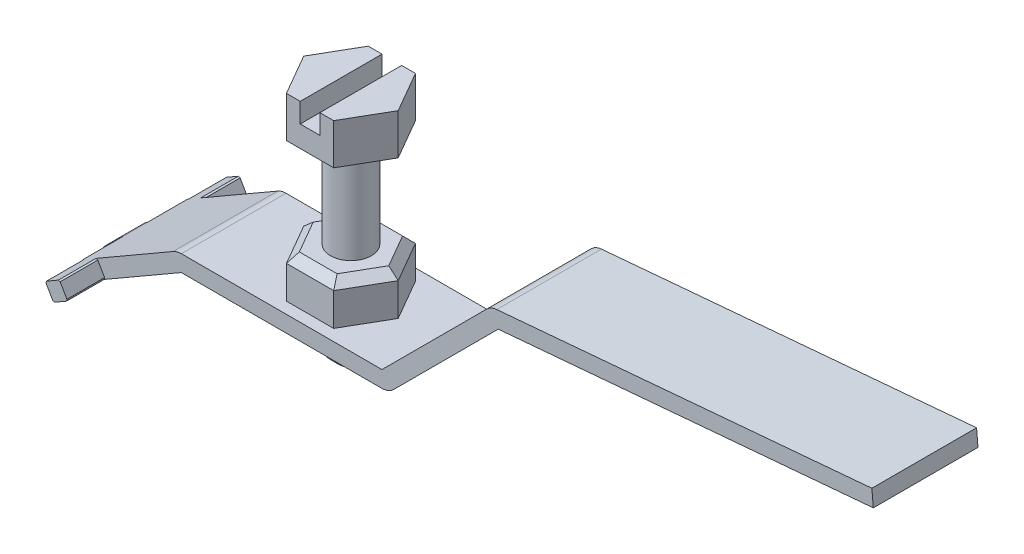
from build123d import *

# Parameters (mm, degrees)
BOSS_EXTRU_1_DEPTH      = 3.2
BOSS_EXTRU_2_DEPTH      = 5.5
ESQUISSE3_OUTSIDE_W     = 60.549
ESQUISSE3_OUTSIDE_H     = 25.111
ESQUISSE3_OUTSIDE_R     = 0.65
ENL_V_MAT_EXTRU_1_DEPTH = 2.3
ESQUISSE4_OUTSIDE_W     = 60.549
ESQUISSE4_OUTSIDE_H     = 25.111
ESQUISSE4_OUTSIDE_R     = 0.65
ENL_V_MAT_EXTRU_2_DEPTH = 2.3
ESQUISSE6_R             = 1.5
ENL_V_MAT_EXTRU_3_DEPTH = 11
ESQUISSE7_R             = 1
BOSS_EXTRU_3_DEPTH      = 2.5
CHANFREIN1_SIZE         = 0.5
BOSS_EXTRU_4_DEPTH      = 6
BOSS_EXTRU_4_DEPTH_BACK = 6
ESQUISSE8_R             = 1.25
CHANFREIN2_SIZE         = 0.5
BOSS_EXTRU_5_DEPTH      = 2.5
ESQUISSE10_W            = 1.2
ESQUISSE10_H            = 1.2
ENL_V_MAT_EXTRU_4_DEPTH = 5
BOSS_EXTRU_6_DEPTH      = 0.75


with BuildPart() as part:
    # Esquisse1 → Boss.-Extru.1 (new, symmetric)
    with BuildSketch(Plane.XY):
        with BuildLine():
            Line((0.25, -0.433012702), (5.330127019, 2.5))
            Line((5.330127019, 2.5), (17.596740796, 2.5))
            ThreePointArc((17.596740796, 2.5), (17.979424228, 2.576120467), (18.303847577, 2.792893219))
            Line((18.303847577, 2.792893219), (24.698535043, 9.187580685))
            Line((24.698535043, 9.187580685), (47.628265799, 11.193672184))
            Line((47.628265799, 11.193672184), (47.541110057, 12.189866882))
            Line((47.541110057, 12.189866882), (24.611379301, 10.183775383))
            ThreePointArc((24.611379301, 10.183775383), (24.275916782, 10.093888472), (23.991428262, 9.894687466))
            Line((23.991428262, 9.894687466), (17.596740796, 3.5))
            Line((17.596740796, 3.5), (5.330127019, 3.5))
            ThreePointArc((5.330127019, 3.5), (5.071307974, 3.465925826), (4.830127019, 3.366025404))
            Line((4.830127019, 3.366025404), (-0.25, 0.433012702))
            Line((-0.25, 0.433012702), (-0.683012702, 0.183012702))
            Line((-0.683012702, 0.183012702), (-0.183012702, -0.683012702))
            Line((-0.183012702, -0.683012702), (0.25, -0.433012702))
        make_face()
    extrude(amount=BOSS_EXTRU_1_DEPTH, both=True)

    # Esquisse2 → Boss.-Extru.2 (add, symmetric)
    with BuildSketch(Plane.XY):
        Polygon((-0.683012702, 0.183012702), (-0.183012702, -0.683012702), (0.683012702, -0.183012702), (0.183012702, 0.683012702), align=None)
    extrude(amount=BOSS_EXTRU_2_DEPTH, both=True)

    # Esquisse3 outside → Enl_v. mat.-Extru.1 (cut)
    with BuildSketch(Plane.XY.offset(5.5)):
        with Locations((23.4725, 5.7535)):
            Rectangle(ESQUISSE3_OUTSIDE_W, ESQUISSE3_OUTSIDE_H)
        Circle(ESQUISSE3_OUTSIDE_R, mode=Mode.SUBTRACT)
    extrude(amount=-ENL_V_MAT_EXTRU_1_DEPTH, mode=Mode.SUBTRACT)

    # Esquisse4 outside → Enl_v. mat.-Extru.2 (cut)
    with BuildSketch(Plane(origin=(0, 0, -5.5), x_dir=(-1, 0, 0), z_dir=(0, 0, -1))):
        with Locations((-23.4725, 5.7535)):
            Rectangle(ESQUISSE4_OUTSIDE_W, ESQUISSE4_OUTSIDE_H)
        Circle(ESQUISSE4_OUTSIDE_R, mode=Mode.SUBTRACT)
    extrude(amount=-ENL_V_MAT_EXTRU_2_DEPTH, mode=Mode.SUBTRACT)

    # Esquisse6 → Enl_v. mat.-Extru.3 (cut)
    with BuildSketch(Plane(origin=(0, 3.5, 0), x_dir=(1, 0, 0), z_dir=(0, 1, 0))):
        with Locations(Location((12.5, 0, 0), (0, 0, 270))):
            Circle(ESQUISSE6_R)
    extrude(amount=-ENL_V_MAT_EXTRU_3_DEPTH, mode=Mode.SUBTRACT)

    # Esquisse11 → Boss.-Extru.6 (add, symmetric)
    with BuildSketch(Plane.XY):
        with BuildLine():
            Line((-0.183012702, -0.683012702), (-1.103553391, -1.603553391))
            ThreePointArc((-1.103553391, -1.603553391), (-1.810660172, -1.603553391), (-1.810660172, -0.896446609))
            Line((-1.810660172, -0.896446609), (-0.890119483, 0.024094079))
            ThreePointArc((-0.890119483, 0.024094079), (-0.791774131, 0.110340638), (-0.683012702, 0.183012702))
            Line((-0.683012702, 0.183012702), (-0.183012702, -0.683012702))
        make_face()
    extrude(amount=BOSS_EXTRU_6_DEPTH, both=True)


with BuildPart() as body_2:
    # Esquisse7 → Boss.-Extru.3 (new body)
    with BuildSketch(Plane(origin=(0, 3.5, 0), x_dir=(1, 0, 0), z_dir=(0, 1, 0))):
        Polygon((15.386751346, 0), (13.943375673, 2.5), (11.056624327, 2.5), (9.613248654, 0), (11.056624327, -2.5), (13.943375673, -2.5), align=None)
        with Locations(Location((12.5, 0, 0), (0, 0, 270))):
            Circle(ESQUISSE7_R, mode=Mode.SUBTRACT)
    extrude(amount=BOSS_EXTRU_3_DEPTH)

    # Chanfrein1
    chanfrein1_edges = [body_2.edges().sort_by_distance(p)[0] for p in [
        (12.5, 6, -2.5),
        (10.334936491, 6, -1.25),
        (10.334936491, 6, 1.25),
        (12.5, 6, 2.5),
        (14.665063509, 6, 1.25),
        (14.665063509, 6, -1.25),
    ]]
    chamfer(chanfrein1_edges, length=CHANFREIN1_SIZE)


with BuildPart() as body_3:
    # Esquisse8 → Boss.-Extru.4 (new, two sides: drawn at the far end of the back side and taken through both)
    with BuildSketch(Plane(origin=(0, 6, 0), x_dir=(1, 0, 0), z_dir=(0, 1, 0)).offset(-BOSS_EXTRU_4_DEPTH_BACK)):
        with Locations(Location((12.5, 0, 0), (0, 0, 270))):
            Circle(ESQUISSE8_R)
    extrude(amount=BOSS_EXTRU_4_DEPTH + BOSS_EXTRU_4_DEPTH_BACK)

    # Chanfrein2
    chanfrein2_edges = [body_3.edges().sort_by_distance(p)[0] for p in [
        (12.5, 0, -1.25),
    ]]
    chamfer(chanfrein2_edges, length=CHANFREIN2_SIZE)

    # Esquisse9 → Boss.-Extru.5 (add)
    with BuildSketch(Plane(origin=(0, 12, 0), x_dir=(1, 0, 0), z_dir=(0, 1, 0))):
        Polygon((13.943375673, 2.5), (11.056624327, 2.5), (9.613248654, 0), (11.056624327, -2.5), (13.943375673, -2.5), (15.386751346, 0), align=None)
    extrude(amount=BOSS_EXTRU_5_DEPTH)

    # Esquisse10 → Enl_v. mat.-Extru.4 (cut, symmetric)
    with BuildSketch(Plane.XY):
        with Locations((12.5, 13.9)):
            Rectangle(ESQUISSE10_W, ESQUISSE10_H)
    extrude(amount=ENL_V_MAT_EXTRU_4_DEPTH, both=True, mode=Mode.SUBTRACT)


solid = Compound([part.part, body_2.part, body_3.part])
